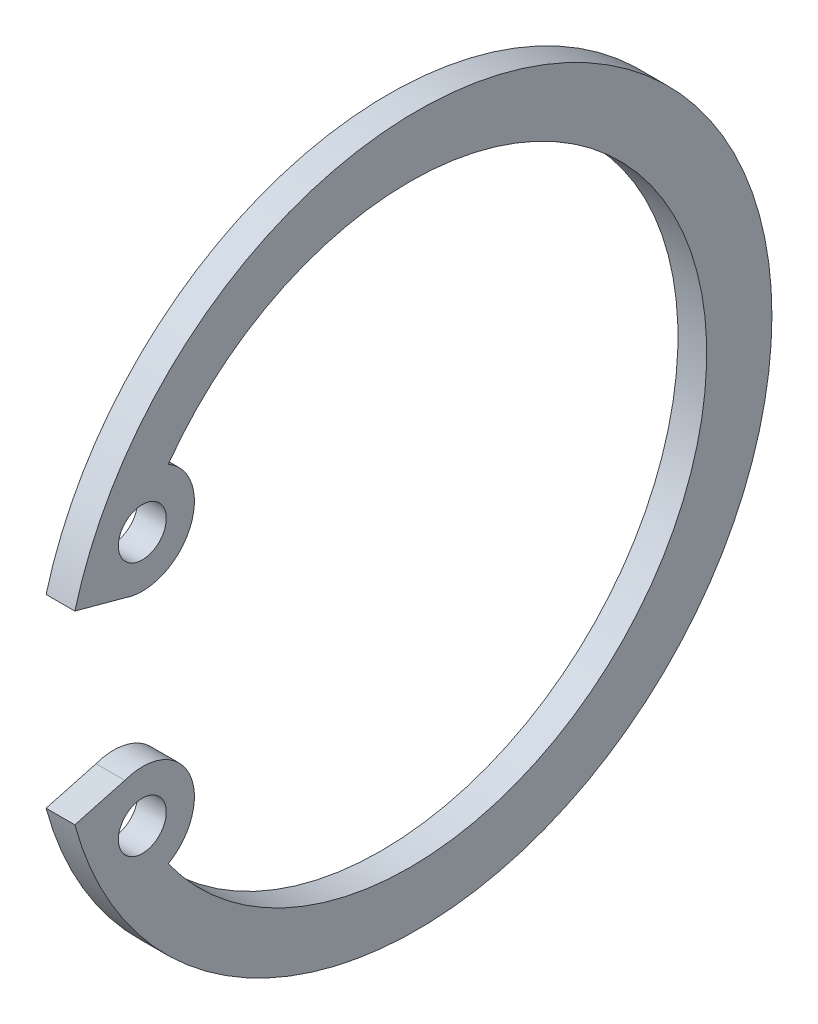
ISO-10303-21;
HEADER;
FILE_DESCRIPTION(('STEP AP214'),'2;1');
FILE_NAME('part.step','',(''),(''),'','','');
FILE_SCHEMA(('AUTOMOTIVE_DESIGN { 1 0 10303 214 1 1 1 1 }'));
ENDSEC;
DATA;
#1=APPLICATION_CONTEXT('core data for automotive mechanical design processes');
#2=APPLICATION_PROTOCOL_DEFINITION('international standard','automotive_design',2000,#1);
#3=PRODUCT_CONTEXT('',#1,'mechanical');
#4=PRODUCT('Part','Part','',(#3));
#5=PRODUCT_RELATED_PRODUCT_CATEGORY('part','',(#4));
#6=PRODUCT_DEFINITION_FORMATION('','',#4);
#7=PRODUCT_DEFINITION_CONTEXT('part definition',#1,'design');
#8=PRODUCT_DEFINITION('design','',#6,#7);
#9=PRODUCT_DEFINITION_SHAPE('','',#8);
#10=(LENGTH_UNIT() NAMED_UNIT(*) SI_UNIT(.MILLI.,.METRE.));
#11=(NAMED_UNIT(*) PLANE_ANGLE_UNIT() SI_UNIT($,.RADIAN.));
#12=(NAMED_UNIT(*) SI_UNIT($,.STERADIAN.) SOLID_ANGLE_UNIT());
#13=UNCERTAINTY_MEASURE_WITH_UNIT(LENGTH_MEASURE(1.E-05),#10,'distance_accuracy_value','');
#14=(GEOMETRIC_REPRESENTATION_CONTEXT(3) GLOBAL_UNCERTAINTY_ASSIGNED_CONTEXT((#13)) GLOBAL_UNIT_ASSIGNED_CONTEXT((#10,
#11,#12)) REPRESENTATION_CONTEXT('',''));
#15=CARTESIAN_POINT('',(0.,0.,0.));
#16=DIRECTION('',(0.,0.,1.));
#17=DIRECTION('',(1.,0.,0.));
#18=AXIS2_PLACEMENT_3D('',#15,#16,#17);
#19=CARTESIAN_POINT('',(9.44999998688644,-80.1327111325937,49.3404092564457));
#20=DIRECTION('',(-1.,0.,0.));
#21=DIRECTION('',(0.,0.,1.));
#22=AXIS2_PLACEMENT_3D('',#19,#20,#21);
#23=CYLINDRICAL_SURFACE('',#22,1.25);
#24=CARTESIAN_POINT('',(7.94999998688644,-80.1327111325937,49.3404092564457));
#25=DIRECTION('',(1.,0.,0.));
#26=DIRECTION('',(0.,1.,0.));
#27=AXIS2_PLACEMENT_3D('',#24,#25,#26);
#28=CIRCLE('',#27,1.25);
#29=CARTESIAN_POINT('',(7.94999998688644,-78.8827111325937,49.3404092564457));
#30=VERTEX_POINT('',#29);
#31=EDGE_CURVE('E123',#30,#30,#28,.T.);
#32=ORIENTED_EDGE('',*,*,#31,.F.);
#33=EDGE_LOOP('',(#32));
#34=FACE_BOUND('',#33,.T.);
#35=CARTESIAN_POINT('',(9.44999998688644,-80.1327111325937,49.3404092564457));
#36=DIRECTION('',(-1.,0.,0.));
#37=DIRECTION('',(0.,0.,1.));
#38=AXIS2_PLACEMENT_3D('',#35,#36,#37);
#39=CIRCLE('',#38,1.25);
#40=CARTESIAN_POINT('',(9.44999998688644,-80.1327111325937,50.5904092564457));
#41=VERTEX_POINT('',#40);
#42=EDGE_CURVE('E119',#41,#41,#39,.T.);
#43=ORIENTED_EDGE('',*,*,#42,.F.);
#44=EDGE_LOOP('',(#43));
#45=FACE_BOUND('',#44,.T.);
#46=ADVANCED_FACE('F15',(#34,#45),#23,.F.);
#47=CARTESIAN_POINT('',(9.44999998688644,-66.8673182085,49.3404092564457));
#48=DIRECTION('',(-1.,0.,0.));
#49=DIRECTION('',(0.,0.,1.));
#50=AXIS2_PLACEMENT_3D('',#47,#48,#49);
#51=CYLINDRICAL_SURFACE('',#50,1.25);
#52=CARTESIAN_POINT('',(7.94999998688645,-66.8673182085,49.3404092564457));
#53=DIRECTION('',(1.,0.,0.));
#54=DIRECTION('',(0.,1.,0.));
#55=AXIS2_PLACEMENT_3D('',#52,#53,#54);
#56=CIRCLE('',#55,1.25);
#57=CARTESIAN_POINT('',(7.94999998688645,-65.6173182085,49.3404092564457));
#58=VERTEX_POINT('',#57);
#59=EDGE_CURVE('E120',#58,#58,#56,.T.);
#60=ORIENTED_EDGE('',*,*,#59,.F.);
#61=EDGE_LOOP('',(#60));
#62=FACE_BOUND('',#61,.T.);
#63=CARTESIAN_POINT('',(9.44999998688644,-66.8673182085,49.3404092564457));
#64=DIRECTION('',(-1.,0.,0.));
#65=DIRECTION('',(0.,0.,1.));
#66=AXIS2_PLACEMENT_3D('',#63,#64,#65);
#67=CIRCLE('',#66,1.25);
#68=CARTESIAN_POINT('',(9.44999998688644,-66.8673182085,50.5904092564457));
#69=VERTEX_POINT('',#68);
#70=EDGE_CURVE('E75',#69,#69,#67,.T.);
#71=ORIENTED_EDGE('',*,*,#70,.F.);
#72=EDGE_LOOP('',(#71));
#73=FACE_BOUND('',#72,.T.);
#74=ADVANCED_FACE('F133',(#62,#73),#51,.F.);
#75=CARTESIAN_POINT('',(9.44999998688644,-73.5000146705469,35.0000000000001));
#76=DIRECTION('',(-1.,0.,0.));
#77=DIRECTION('',(0.,0.,1.));
#78=AXIS2_PLACEMENT_3D('',#75,#76,#77);
#79=CYLINDRICAL_SURFACE('',#78,18.4999999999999);
#80=CARTESIAN_POINT('',(7.94999998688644,-73.5000146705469,35.0000000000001));
#81=DIRECTION('',(1.,0.,0.));
#82=DIRECTION('',(0.,1.,0.));
#83=AXIS2_PLACEMENT_3D('',#80,#81,#82);
#84=CIRCLE('',#83,18.4999999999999);
#85=CARTESIAN_POINT('',(7.94999998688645,-78.3268316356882,52.8592227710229));
#86=VERTEX_POINT('',#85);
#87=CARTESIAN_POINT('',(7.94999998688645,-68.6731977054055,52.8592227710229));
#88=VERTEX_POINT('',#87);
#89=EDGE_CURVE('E9',#86,#88,#84,.T.);
#90=ORIENTED_EDGE('',*,*,#89,.T.);
#91=DIRECTION('',(-1.,0.,0.));
#92=VECTOR('',#91,1.);
#93=CARTESIAN_POINT('',(9.44999998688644,-68.6731977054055,52.8592227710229));
#94=LINE('',#93,#92);
#95=CARTESIAN_POINT('',(9.44999998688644,-68.6731977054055,52.8592227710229));
#96=VERTEX_POINT('',#95);
#97=EDGE_CURVE('E34',#96,#88,#94,.T.);
#98=ORIENTED_EDGE('',*,*,#97,.F.);
#99=CARTESIAN_POINT('',(9.44999998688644,-73.5000146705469,35.0000000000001));
#100=DIRECTION('',(-1.,0.,0.));
#101=DIRECTION('',(0.,0.,1.));
#102=AXIS2_PLACEMENT_3D('',#99,#100,#101);
#103=CIRCLE('',#102,18.4999999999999);
#104=CARTESIAN_POINT('',(9.44999998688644,-78.3268316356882,52.8592227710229));
#105=VERTEX_POINT('',#104);
#106=EDGE_CURVE('E25',#96,#105,#103,.T.);
#107=ORIENTED_EDGE('',*,*,#106,.T.);
#108=DIRECTION('',(-1.,0.,0.));
#109=VECTOR('',#108,1.);
#110=CARTESIAN_POINT('',(9.44999998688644,-78.3268316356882,52.8592227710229));
#111=LINE('',#110,#109);
#112=EDGE_CURVE('E90',#105,#86,#111,.T.);
#113=ORIENTED_EDGE('',*,*,#112,.T.);
#114=EDGE_LOOP('',(#90,#98,#107,#113));
#115=FACE_BOUND('',#114,.T.);
#116=ADVANCED_FACE('F151',(#115),#79,.T.);
#117=CARTESIAN_POINT('',(9.44999998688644,-68.6731977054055,52.8592227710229));
#118=DIRECTION('',(0.,-0.965363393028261,0.260909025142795));
#119=DIRECTION('',(0.,-0.260909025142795,-0.965363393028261));
#120=AXIS2_PLACEMENT_3D('',#117,#118,#119);
#121=PLANE('',#120);
#122=DIRECTION('',(0.,-0.260909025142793,-0.965363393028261));
#123=VECTOR('',#122,1.);
#124=CARTESIAN_POINT('',(7.94999998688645,-68.6731977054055,52.8592227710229));
#125=LINE('',#124,#123);
#126=CARTESIAN_POINT('',(7.94999998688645,-69.3776520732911,50.2527416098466));
#127=VERTEX_POINT('',#126);
#128=EDGE_CURVE('E111',#88,#127,#125,.T.);
#129=ORIENTED_EDGE('',*,*,#128,.T.);
#130=DIRECTION('',(-1.,0.,0.));
#131=VECTOR('',#130,1.);
#132=CARTESIAN_POINT('',(9.44999998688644,-69.3776520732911,50.2527416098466));
#133=LINE('',#132,#131);
#134=CARTESIAN_POINT('',(9.44999998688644,-69.3776520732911,50.2527416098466));
#135=VERTEX_POINT('',#134);
#136=EDGE_CURVE('E101',#135,#127,#133,.T.);
#137=ORIENTED_EDGE('',*,*,#136,.F.);
#138=DIRECTION('',(0.,0.260909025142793,0.965363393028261));
#139=VECTOR('',#138,1.);
#140=CARTESIAN_POINT('',(9.44999998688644,-69.3776520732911,50.2527416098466));
#141=LINE('',#140,#139);
#142=EDGE_CURVE('E109',#135,#96,#141,.T.);
#143=ORIENTED_EDGE('',*,*,#142,.T.);
#144=ORIENTED_EDGE('',*,*,#97,.T.);
#145=EDGE_LOOP('',(#129,#137,#143,#144));
#146=FACE_BOUND('',#145,.T.);
#147=ADVANCED_FACE('F156',(#146),#121,.T.);
#148=CARTESIAN_POINT('',(9.44999998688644,-66.8281047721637,49.333289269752));
#149=DIRECTION('',(-1.,0.,0.));
#150=DIRECTION('',(0.,0.,1.));
#151=AXIS2_PLACEMENT_3D('',#148,#149,#150);
#152=CYLINDRICAL_SURFACE('',#151,2.71027379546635);
#153=CARTESIAN_POINT('',(7.94999998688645,-66.8281047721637,49.333289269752));
#154=DIRECTION('',(1.,0.,0.));
#155=DIRECTION('',(0.,1.,0.));
#156=AXIS2_PLACEMENT_3D('',#153,#154,#155);
#157=CIRCLE('',#156,2.71027379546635);
#158=CARTESIAN_POINT('',(7.94999998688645,-64.4764995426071,47.9858706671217));
#159=VERTEX_POINT('',#158);
#160=EDGE_CURVE('E105',#127,#159,#157,.T.);
#161=ORIENTED_EDGE('',*,*,#160,.T.);
#162=DIRECTION('',(-1.,0.,0.));
#163=VECTOR('',#162,1.);
#164=CARTESIAN_POINT('',(9.44999998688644,-64.4764995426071,47.9858706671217));
#165=LINE('',#164,#163);
#166=CARTESIAN_POINT('',(9.44999998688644,-64.4764995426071,47.9858706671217));
#167=VERTEX_POINT('',#166);
#168=EDGE_CURVE('E96',#167,#159,#165,.T.);
#169=ORIENTED_EDGE('',*,*,#168,.F.);
#170=CARTESIAN_POINT('',(9.44999998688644,-66.8281047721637,49.333289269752));
#171=DIRECTION('',(-1.,0.,0.));
#172=DIRECTION('',(0.,0.,1.));
#173=AXIS2_PLACEMENT_3D('',#170,#171,#172);
#174=CIRCLE('',#173,2.71027379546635);
#175=EDGE_CURVE('E102',#167,#135,#174,.T.);
#176=ORIENTED_EDGE('',*,*,#175,.T.);
#177=ORIENTED_EDGE('',*,*,#136,.T.);
#178=EDGE_LOOP('',(#161,#169,#176,#177));
#179=FACE_BOUND('',#178,.T.);
#180=ADVANCED_FACE('F158',(#179),#152,.T.);
#181=CARTESIAN_POINT('',(9.44999998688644,-73.5000146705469,35.3924867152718));
#182=DIRECTION('',(-1.,0.,0.));
#183=DIRECTION('',(0.,0.,1.));
#184=AXIS2_PLACEMENT_3D('',#181,#182,#183);
#185=CYLINDRICAL_SURFACE('',#184,15.4924867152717);
#186=CARTESIAN_POINT('',(7.94999998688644,-73.5000146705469,35.3924867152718));
#187=DIRECTION('',(-1.,0.,0.));
#188=DIRECTION('',(0.,0.,1.));
#189=AXIS2_PLACEMENT_3D('',#186,#187,#188);
#190=CIRCLE('',#189,15.4924867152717);
#191=CARTESIAN_POINT('',(7.94999998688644,-82.5235297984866,47.9858706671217));
#192=VERTEX_POINT('',#191);
#193=EDGE_CURVE('E97',#159,#192,#190,.T.);
#194=ORIENTED_EDGE('',*,*,#193,.T.);
#195=DIRECTION('',(-1.,0.,0.));
#196=VECTOR('',#195,1.);
#197=CARTESIAN_POINT('',(9.44999998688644,-82.5235297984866,47.9858706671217));
#198=LINE('',#197,#196);
#199=CARTESIAN_POINT('',(9.44999998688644,-82.5235297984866,47.9858706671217));
#200=VERTEX_POINT('',#199);
#201=EDGE_CURVE('E86',#200,#192,#198,.T.);
#202=ORIENTED_EDGE('',*,*,#201,.F.);
#203=CARTESIAN_POINT('',(9.44999998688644,-73.5000146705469,35.3924867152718));
#204=DIRECTION('',(1.,0.,0.));
#205=DIRECTION('',(0.,1.,0.));
#206=AXIS2_PLACEMENT_3D('',#203,#204,#205);
#207=CIRCLE('',#206,15.4924867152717);
#208=EDGE_CURVE('E85',#200,#167,#207,.T.);
#209=ORIENTED_EDGE('',*,*,#208,.T.);
#210=ORIENTED_EDGE('',*,*,#168,.T.);
#211=EDGE_LOOP('',(#194,#202,#209,#210));
#212=FACE_BOUND('',#211,.T.);
#213=ADVANCED_FACE('F17',(#212),#185,.F.);
#214=CARTESIAN_POINT('',(9.44999998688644,-80.17192456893,49.3332892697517));
#215=DIRECTION('',(-1.,0.,0.));
#216=DIRECTION('',(0.,0.,1.));
#217=AXIS2_PLACEMENT_3D('',#214,#215,#216);
#218=CYLINDRICAL_SURFACE('',#217,2.71027379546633);
#219=CARTESIAN_POINT('',(7.94999998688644,-80.17192456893,49.3332892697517));
#220=DIRECTION('',(1.,0.,0.));
#221=DIRECTION('',(0.,1.,0.));
#222=AXIS2_PLACEMENT_3D('',#219,#220,#221);
#223=CIRCLE('',#222,2.71027379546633);
#224=CARTESIAN_POINT('',(7.94999998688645,-77.6223772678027,50.2527416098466));
#225=VERTEX_POINT('',#224);
#226=EDGE_CURVE('E73',#192,#225,#223,.T.);
#227=ORIENTED_EDGE('',*,*,#226,.T.);
#228=DIRECTION('',(-1.,0.,0.));
#229=VECTOR('',#228,1.);
#230=CARTESIAN_POINT('',(9.44999998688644,-77.6223772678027,50.2527416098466));
#231=LINE('',#230,#229);
#232=CARTESIAN_POINT('',(9.44999998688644,-77.6223772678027,50.2527416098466));
#233=VERTEX_POINT('',#232);
#234=EDGE_CURVE('E65',#233,#225,#231,.T.);
#235=ORIENTED_EDGE('',*,*,#234,.F.);
#236=CARTESIAN_POINT('',(9.44999998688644,-80.17192456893,49.3332892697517));
#237=DIRECTION('',(-1.,0.,0.));
#238=DIRECTION('',(0.,0.,1.));
#239=AXIS2_PLACEMENT_3D('',#236,#237,#238);
#240=CIRCLE('',#239,2.71027379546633);
#241=EDGE_CURVE('E71',#233,#200,#240,.T.);
#242=ORIENTED_EDGE('',*,*,#241,.T.);
#243=ORIENTED_EDGE('',*,*,#201,.T.);
#244=EDGE_LOOP('',(#227,#235,#242,#243));
#245=FACE_BOUND('',#244,.T.);
#246=ADVANCED_FACE('F70',(#245),#218,.T.);
#247=CARTESIAN_POINT('',(9.44999998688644,-77.6223772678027,50.2527416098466));
#248=DIRECTION('',(0.,0.965363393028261,0.260909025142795));
#249=DIRECTION('',(0.,-0.260909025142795,0.965363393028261));
#250=AXIS2_PLACEMENT_3D('',#247,#248,#249);
#251=PLANE('',#250);
#252=DIRECTION('',(0.,-0.260909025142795,0.965363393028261));
#253=VECTOR('',#252,1.);
#254=CARTESIAN_POINT('',(7.94999998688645,-77.6223772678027,50.2527416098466));
#255=LINE('',#254,#253);
#256=EDGE_CURVE('E92',#225,#86,#255,.T.);
#257=ORIENTED_EDGE('',*,*,#256,.T.);
#258=ORIENTED_EDGE('',*,*,#112,.F.);
#259=DIRECTION('',(0.,0.260909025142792,-0.965363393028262));
#260=VECTOR('',#259,1.);
#261=CARTESIAN_POINT('',(9.44999998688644,-78.3268316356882,52.8592227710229));
#262=LINE('',#261,#260);
#263=EDGE_CURVE('E19',#105,#233,#262,.T.);
#264=ORIENTED_EDGE('',*,*,#263,.T.);
#265=ORIENTED_EDGE('',*,*,#234,.T.);
#266=EDGE_LOOP('',(#257,#258,#264,#265));
#267=FACE_BOUND('',#266,.T.);
#268=ADVANCED_FACE('F88',(#267),#251,.T.);
#269=CARTESIAN_POINT('',(9.44999998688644,-73.5000146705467,35.8830458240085));
#270=DIRECTION('',(-1.,0.,0.));
#271=DIRECTION('',(0.,0.,1.));
#272=AXIS2_PLACEMENT_3D('',#269,#270,#271);
#273=PLANE('',#272);
#274=ORIENTED_EDGE('',*,*,#263,.F.);
#275=ORIENTED_EDGE('',*,*,#106,.F.);
#276=ORIENTED_EDGE('',*,*,#142,.F.);
#277=ORIENTED_EDGE('',*,*,#175,.F.);
#278=ORIENTED_EDGE('',*,*,#208,.F.);
#279=ORIENTED_EDGE('',*,*,#241,.F.);
#280=EDGE_LOOP('',(#274,#275,#276,#277,#278,#279));
#281=FACE_BOUND('',#280,.T.);
#282=ORIENTED_EDGE('',*,*,#70,.T.);
#283=EDGE_LOOP('',(#282));
#284=FACE_BOUND('',#283,.T.);
#285=ORIENTED_EDGE('',*,*,#42,.T.);
#286=EDGE_LOOP('',(#285));
#287=FACE_BOUND('',#286,.T.);
#288=ADVANCED_FACE('F80',(#281,#284,#287),#273,.F.);
#289=CARTESIAN_POINT('',(7.94999998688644,-73.5000146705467,35.8830458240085));
#290=DIRECTION('',(-1.,0.,0.));
#291=DIRECTION('',(0.,0.,1.));
#292=AXIS2_PLACEMENT_3D('',#289,#290,#291);
#293=PLANE('',#292);
#294=ORIENTED_EDGE('',*,*,#89,.F.);
#295=ORIENTED_EDGE('',*,*,#256,.F.);
#296=ORIENTED_EDGE('',*,*,#226,.F.);
#297=ORIENTED_EDGE('',*,*,#193,.F.);
#298=ORIENTED_EDGE('',*,*,#160,.F.);
#299=ORIENTED_EDGE('',*,*,#128,.F.);
#300=EDGE_LOOP('',(#294,#295,#296,#297,#298,#299));
#301=FACE_BOUND('',#300,.T.);
#302=ORIENTED_EDGE('',*,*,#59,.T.);
#303=EDGE_LOOP('',(#302));
#304=FACE_BOUND('',#303,.T.);
#305=ORIENTED_EDGE('',*,*,#31,.T.);
#306=EDGE_LOOP('',(#305));
#307=FACE_BOUND('',#306,.T.);
#308=ADVANCED_FACE('F129',(#301,#304,#307),#293,.T.);
#309=CLOSED_SHELL('',(#46,#74,#116,#147,#180,#213,#246,#268,#288,#308));
#310=MANIFOLD_SOLID_BREP('B1',#309);
#311=ADVANCED_BREP_SHAPE_REPRESENTATION('',(#18,#310),#14);
#312=SHAPE_DEFINITION_REPRESENTATION(#9,#311);
ENDSEC;
END-ISO-10303-21;
